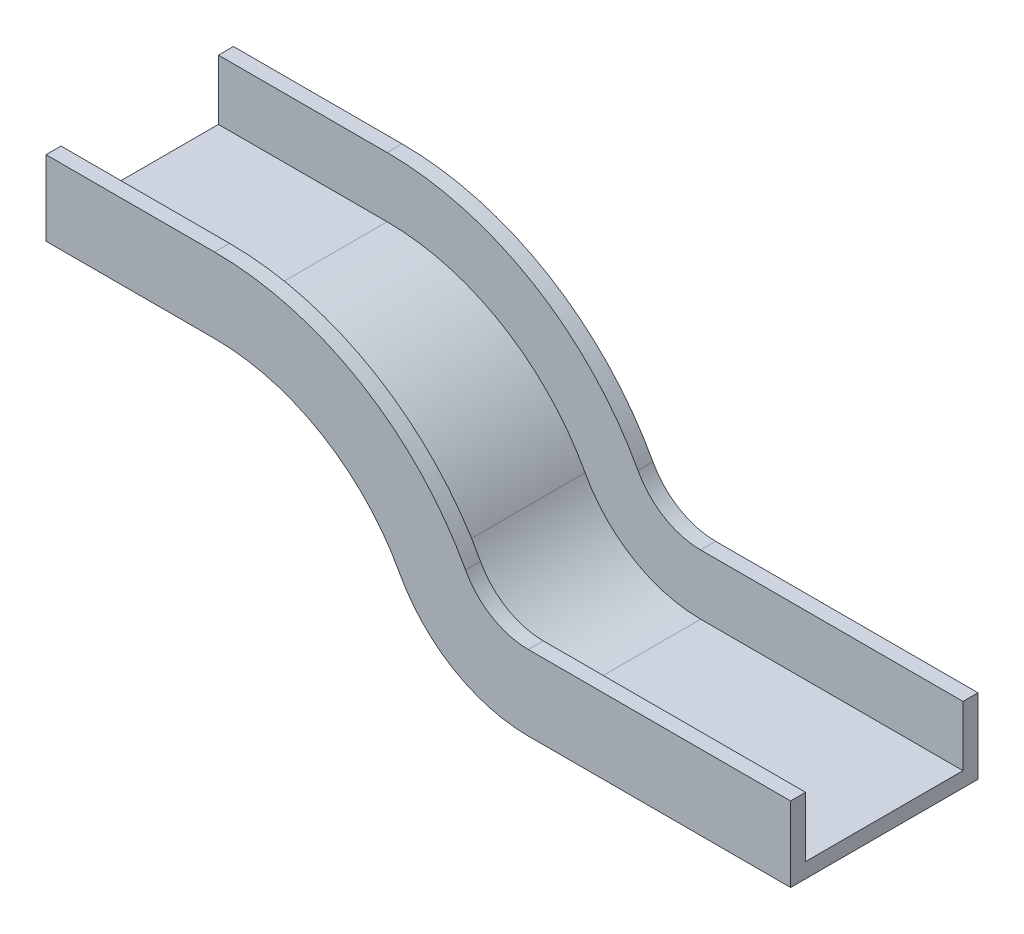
ISO-10303-21;
HEADER;
FILE_DESCRIPTION(('STEP AP214'),'2;1');
FILE_NAME('part.step','',(''),(''),'','','');
FILE_SCHEMA(('AUTOMOTIVE_DESIGN { 1 0 10303 214 1 1 1 1 }'));
ENDSEC;
DATA;
#1=APPLICATION_CONTEXT('core data for automotive mechanical design processes');
#2=APPLICATION_PROTOCOL_DEFINITION('international standard','automotive_design',2000,#1);
#3=PRODUCT_CONTEXT('',#1,'mechanical');
#4=PRODUCT('Part','Part','',(#3));
#5=PRODUCT_RELATED_PRODUCT_CATEGORY('part','',(#4));
#6=PRODUCT_DEFINITION_FORMATION('','',#4);
#7=PRODUCT_DEFINITION_CONTEXT('part definition',#1,'design');
#8=PRODUCT_DEFINITION('design','',#6,#7);
#9=PRODUCT_DEFINITION_SHAPE('','',#8);
#10=(LENGTH_UNIT() NAMED_UNIT(*) SI_UNIT(.MILLI.,.METRE.));
#11=(NAMED_UNIT(*) PLANE_ANGLE_UNIT() SI_UNIT($,.RADIAN.));
#12=(NAMED_UNIT(*) SI_UNIT($,.STERADIAN.) SOLID_ANGLE_UNIT());
#13=UNCERTAINTY_MEASURE_WITH_UNIT(LENGTH_MEASURE(1.E-05),#10,'distance_accuracy_value','');
#14=(GEOMETRIC_REPRESENTATION_CONTEXT(3) GLOBAL_UNCERTAINTY_ASSIGNED_CONTEXT((#13)) GLOBAL_UNIT_ASSIGNED_CONTEXT((#10,
#11,#12)) REPRESENTATION_CONTEXT('',''));
#15=CARTESIAN_POINT('',(0.,0.,0.));
#16=DIRECTION('',(0.,0.,1.));
#17=DIRECTION('',(1.,0.,0.));
#18=AXIS2_PLACEMENT_3D('',#15,#16,#17);
#19=CARTESIAN_POINT('',(128.666002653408,-50.,-21.));
#20=DIRECTION('',(0.,1.,0.));
#21=DIRECTION('',(-1.,0.,0.));
#22=AXIS2_PLACEMENT_3D('',#19,#20,#21);
#23=PLANE('',#22);
#24=DIRECTION('',(0.,0.,1.));
#25=VECTOR('',#24,1.);
#26=CARTESIAN_POINT('',(128.666002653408,-50.,-21.));
#27=LINE('',#26,#25);
#28=CARTESIAN_POINT('',(128.666002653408,-50.,-21.));
#29=VERTEX_POINT('',#28);
#30=CARTESIAN_POINT('',(128.666002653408,-50.,21.));
#31=VERTEX_POINT('',#30);
#32=EDGE_CURVE('E279',#29,#31,#27,.T.);
#33=ORIENTED_EDGE('',*,*,#32,.T.);
#34=DIRECTION('',(1.,0.,0.));
#35=VECTOR('',#34,1.);
#36=CARTESIAN_POINT('',(128.666002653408,-50.,21.));
#37=LINE('',#36,#35);
#38=CARTESIAN_POINT('',(198.666002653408,-50.,21.));
#39=VERTEX_POINT('',#38);
#40=EDGE_CURVE('E340',#31,#39,#37,.T.);
#41=ORIENTED_EDGE('',*,*,#40,.T.);
#42=DIRECTION('',(0.,0.,1.));
#43=VECTOR('',#42,1.);
#44=CARTESIAN_POINT('',(198.666002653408,-50.,-21.));
#45=LINE('',#44,#43);
#46=CARTESIAN_POINT('',(198.666002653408,-50.,-21.));
#47=VERTEX_POINT('',#46);
#48=EDGE_CURVE('E55',#47,#39,#45,.T.);
#49=ORIENTED_EDGE('',*,*,#48,.F.);
#50=DIRECTION('',(1.,0.,0.));
#51=VECTOR('',#50,1.);
#52=CARTESIAN_POINT('',(128.666002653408,-50.,-21.));
#53=LINE('',#52,#51);
#54=EDGE_CURVE('E40',#29,#47,#53,.T.);
#55=ORIENTED_EDGE('',*,*,#54,.F.);
#56=EDGE_LOOP('',(#33,#41,#49,#55));
#57=FACE_BOUND('',#56,.T.);
#58=ADVANCED_FACE('F33',(#57),#23,.T.);
#59=CARTESIAN_POINT('',(128.666002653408,-34.,21.));
#60=DIRECTION('',(0.,1.,0.));
#61=DIRECTION('',(-1.,0.,0.));
#62=AXIS2_PLACEMENT_3D('',#59,#60,#61);
#63=PLANE('',#62);
#64=DIRECTION('',(0.,0.,1.));
#65=VECTOR('',#64,1.);
#66=CARTESIAN_POINT('',(128.666002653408,-34.,21.));
#67=LINE('',#66,#65);
#68=CARTESIAN_POINT('',(128.666002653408,-34.,21.));
#69=VERTEX_POINT('',#68);
#70=CARTESIAN_POINT('',(128.666002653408,-34.,25.));
#71=VERTEX_POINT('',#70);
#72=EDGE_CURVE('E276',#69,#71,#67,.T.);
#73=ORIENTED_EDGE('',*,*,#72,.T.);
#74=DIRECTION('',(1.,0.,0.));
#75=VECTOR('',#74,1.);
#76=CARTESIAN_POINT('',(128.666002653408,-34.,25.));
#77=LINE('',#76,#75);
#78=CARTESIAN_POINT('',(198.666002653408,-34.,25.));
#79=VERTEX_POINT('',#78);
#80=EDGE_CURVE('E334',#71,#79,#77,.T.);
#81=ORIENTED_EDGE('',*,*,#80,.T.);
#82=DIRECTION('',(0.,0.,1.));
#83=VECTOR('',#82,1.);
#84=CARTESIAN_POINT('',(198.666002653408,-34.,21.));
#85=LINE('',#84,#83);
#86=CARTESIAN_POINT('',(198.666002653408,-34.,21.));
#87=VERTEX_POINT('',#86);
#88=EDGE_CURVE('E317',#87,#79,#85,.T.);
#89=ORIENTED_EDGE('',*,*,#88,.F.);
#90=DIRECTION('',(1.,0.,0.));
#91=VECTOR('',#90,1.);
#92=CARTESIAN_POINT('',(128.666002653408,-34.,21.));
#93=LINE('',#92,#91);
#94=EDGE_CURVE('E337',#69,#87,#93,.T.);
#95=ORIENTED_EDGE('',*,*,#94,.F.);
#96=EDGE_LOOP('',(#73,#81,#89,#95));
#97=FACE_BOUND('',#96,.T.);
#98=ADVANCED_FACE('F393',(#97),#63,.T.);
#99=CARTESIAN_POINT('',(128.666002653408,-54.,25.));
#100=DIRECTION('',(0.,-1.,0.));
#101=DIRECTION('',(1.,0.,0.));
#102=AXIS2_PLACEMENT_3D('',#99,#100,#101);
#103=PLANE('',#102);
#104=DIRECTION('',(0.,0.,-1.));
#105=VECTOR('',#104,1.);
#106=CARTESIAN_POINT('',(128.666002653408,-54.,25.));
#107=LINE('',#106,#105);
#108=CARTESIAN_POINT('',(128.666002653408,-54.,25.));
#109=VERTEX_POINT('',#108);
#110=CARTESIAN_POINT('',(128.666002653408,-54.,-25.));
#111=VERTEX_POINT('',#110);
#112=EDGE_CURVE('E273',#109,#111,#107,.T.);
#113=ORIENTED_EDGE('',*,*,#112,.T.);
#114=DIRECTION('',(1.,0.,0.));
#115=VECTOR('',#114,1.);
#116=CARTESIAN_POINT('',(128.666002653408,-54.,-25.));
#117=LINE('',#116,#115);
#118=CARTESIAN_POINT('',(198.666002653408,-54.,-25.));
#119=VERTEX_POINT('',#118);
#120=EDGE_CURVE('E328',#111,#119,#117,.T.);
#121=ORIENTED_EDGE('',*,*,#120,.T.);
#122=DIRECTION('',(0.,0.,-1.));
#123=VECTOR('',#122,1.);
#124=CARTESIAN_POINT('',(198.666002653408,-54.,25.));
#125=LINE('',#124,#123);
#126=CARTESIAN_POINT('',(198.666002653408,-54.,25.));
#127=VERTEX_POINT('',#126);
#128=EDGE_CURVE('E311',#127,#119,#125,.T.);
#129=ORIENTED_EDGE('',*,*,#128,.F.);
#130=DIRECTION('',(1.,0.,0.));
#131=VECTOR('',#130,1.);
#132=CARTESIAN_POINT('',(128.666002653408,-54.,25.));
#133=LINE('',#132,#131);
#134=EDGE_CURVE('E331',#109,#127,#133,.T.);
#135=ORIENTED_EDGE('',*,*,#134,.F.);
#136=EDGE_LOOP('',(#113,#121,#129,#135));
#137=FACE_BOUND('',#136,.T.);
#138=ADVANCED_FACE('F397',(#137),#103,.T.);
#139=CARTESIAN_POINT('',(128.666002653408,-34.,-21.));
#140=DIRECTION('',(0.,1.,0.));
#141=DIRECTION('',(-1.,0.,0.));
#142=AXIS2_PLACEMENT_3D('',#139,#140,#141);
#143=PLANE('',#142);
#144=DIRECTION('',(0.,0.,1.));
#145=VECTOR('',#144,1.);
#146=CARTESIAN_POINT('',(128.666002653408,-34.,-21.));
#147=LINE('',#146,#145);
#148=CARTESIAN_POINT('',(128.666002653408,-34.,-25.));
#149=VERTEX_POINT('',#148);
#150=CARTESIAN_POINT('',(128.666002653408,-34.,-21.));
#151=VERTEX_POINT('',#150);
#152=EDGE_CURVE('E270',#149,#151,#147,.T.);
#153=ORIENTED_EDGE('',*,*,#152,.T.);
#154=DIRECTION('',(1.,0.,0.));
#155=VECTOR('',#154,1.);
#156=CARTESIAN_POINT('',(128.666002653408,-34.,-21.));
#157=LINE('',#156,#155);
#158=CARTESIAN_POINT('',(198.666002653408,-34.,-21.));
#159=VERTEX_POINT('',#158);
#160=EDGE_CURVE('E11',#151,#159,#157,.T.);
#161=ORIENTED_EDGE('',*,*,#160,.T.);
#162=DIRECTION('',(0.,0.,1.));
#163=VECTOR('',#162,1.);
#164=CARTESIAN_POINT('',(198.666002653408,-34.,-21.));
#165=LINE('',#164,#163);
#166=CARTESIAN_POINT('',(198.666002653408,-34.,-25.));
#167=VERTEX_POINT('',#166);
#168=EDGE_CURVE('E306',#167,#159,#165,.T.);
#169=ORIENTED_EDGE('',*,*,#168,.F.);
#170=DIRECTION('',(1.,0.,0.));
#171=VECTOR('',#170,1.);
#172=CARTESIAN_POINT('',(128.666002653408,-34.,-25.));
#173=LINE('',#172,#171);
#174=EDGE_CURVE('E325',#149,#167,#173,.T.);
#175=ORIENTED_EDGE('',*,*,#174,.F.);
#176=EDGE_LOOP('',(#153,#161,#169,#175));
#177=FACE_BOUND('',#176,.T.);
#178=ADVANCED_FACE('F350',(#177),#143,.T.);
#179=CARTESIAN_POINT('',(128.666002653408,-15.,0.));
#180=DIRECTION('',(0.,0.,1.));
#181=DIRECTION('',(1.,0.,0.));
#182=AXIS2_PLACEMENT_3D('',#179,#180,#181);
#183=CYLINDRICAL_SURFACE('',#182,35.);
#184=DIRECTION('',(0.,0.,1.));
#185=VECTOR('',#184,1.);
#186=CARTESIAN_POINT('',(97.8416858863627,-31.5789473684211,-21.));
#187=LINE('',#186,#185);
#188=CARTESIAN_POINT('',(97.8416858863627,-31.5789473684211,-21.));
#189=VERTEX_POINT('',#188);
#190=CARTESIAN_POINT('',(97.8416858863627,-31.5789473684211,21.));
#191=VERTEX_POINT('',#190);
#192=EDGE_CURVE('E245',#189,#191,#187,.T.);
#193=ORIENTED_EDGE('',*,*,#192,.T.);
#194=CARTESIAN_POINT('',(128.666002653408,-15.,21.));
#195=DIRECTION('',(0.,0.,1.));
#196=DIRECTION('',(1.,0.,0.));
#197=AXIS2_PLACEMENT_3D('',#194,#195,#196);
#198=CIRCLE('',#197,35.);
#199=EDGE_CURVE('E297',#191,#31,#198,.T.);
#200=ORIENTED_EDGE('',*,*,#199,.T.);
#201=ORIENTED_EDGE('',*,*,#32,.F.);
#202=CARTESIAN_POINT('',(128.666002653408,-15.,-21.));
#203=DIRECTION('',(0.,0.,1.));
#204=DIRECTION('',(1.,0.,0.));
#205=AXIS2_PLACEMENT_3D('',#202,#203,#204);
#206=CIRCLE('',#205,35.);
#207=EDGE_CURVE('E300',#189,#29,#206,.T.);
#208=ORIENTED_EDGE('',*,*,#207,.F.);
#209=EDGE_LOOP('',(#193,#200,#201,#208));
#210=FACE_BOUND('',#209,.T.);
#211=ADVANCED_FACE('F343',(#210),#183,.F.);
#212=CARTESIAN_POINT('',(128.666002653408,-15.,0.));
#213=DIRECTION('',(0.,0.,1.));
#214=DIRECTION('',(1.,0.,0.));
#215=AXIS2_PLACEMENT_3D('',#212,#213,#214);
#216=CYLINDRICAL_SURFACE('',#215,19.);
#217=DIRECTION('',(0.,0.,1.));
#218=VECTOR('',#217,1.);
#219=CARTESIAN_POINT('',(111.932802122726,-24.,21.));
#220=LINE('',#219,#218);
#221=CARTESIAN_POINT('',(111.932802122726,-24.,21.));
#222=VERTEX_POINT('',#221);
#223=CARTESIAN_POINT('',(111.932802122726,-24.,25.));
#224=VERTEX_POINT('',#223);
#225=EDGE_CURVE('E242',#222,#224,#220,.T.);
#226=ORIENTED_EDGE('',*,*,#225,.T.);
#227=CARTESIAN_POINT('',(128.666002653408,-15.,25.));
#228=DIRECTION('',(0.,0.,1.));
#229=DIRECTION('',(1.,0.,0.));
#230=AXIS2_PLACEMENT_3D('',#227,#228,#229);
#231=CIRCLE('',#230,19.);
#232=EDGE_CURVE('E291',#224,#71,#231,.T.);
#233=ORIENTED_EDGE('',*,*,#232,.T.);
#234=ORIENTED_EDGE('',*,*,#72,.F.);
#235=CARTESIAN_POINT('',(128.666002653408,-15.,21.));
#236=DIRECTION('',(0.,0.,1.));
#237=DIRECTION('',(1.,0.,0.));
#238=AXIS2_PLACEMENT_3D('',#235,#236,#237);
#239=CIRCLE('',#238,19.);
#240=EDGE_CURVE('E294',#222,#69,#239,.T.);
#241=ORIENTED_EDGE('',*,*,#240,.F.);
#242=EDGE_LOOP('',(#226,#233,#234,#241));
#243=FACE_BOUND('',#242,.T.);
#244=ADVANCED_FACE('F409',(#243),#216,.F.);
#245=CARTESIAN_POINT('',(128.666002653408,-15.,0.));
#246=DIRECTION('',(0.,0.,1.));
#247=DIRECTION('',(1.,0.,0.));
#248=AXIS2_PLACEMENT_3D('',#245,#246,#247);
#249=CYLINDRICAL_SURFACE('',#248,39.);
#250=DIRECTION('',(0.,0.,-1.));
#251=VECTOR('',#250,1.);
#252=CARTESIAN_POINT('',(94.3189068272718,-33.4736842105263,25.));
#253=LINE('',#252,#251);
#254=CARTESIAN_POINT('',(94.3189068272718,-33.4736842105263,25.));
#255=VERTEX_POINT('',#254);
#256=CARTESIAN_POINT('',(94.3189068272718,-33.4736842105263,-25.));
#257=VERTEX_POINT('',#256);
#258=EDGE_CURVE('E239',#255,#257,#253,.T.);
#259=ORIENTED_EDGE('',*,*,#258,.T.);
#260=CARTESIAN_POINT('',(128.666002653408,-15.,-25.));
#261=DIRECTION('',(0.,0.,1.));
#262=DIRECTION('',(1.,0.,0.));
#263=AXIS2_PLACEMENT_3D('',#260,#261,#262);
#264=CIRCLE('',#263,39.);
#265=EDGE_CURVE('E285',#257,#111,#264,.T.);
#266=ORIENTED_EDGE('',*,*,#265,.T.);
#267=ORIENTED_EDGE('',*,*,#112,.F.);
#268=CARTESIAN_POINT('',(128.666002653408,-15.,25.));
#269=DIRECTION('',(0.,0.,1.));
#270=DIRECTION('',(1.,0.,0.));
#271=AXIS2_PLACEMENT_3D('',#268,#269,#270);
#272=CIRCLE('',#271,39.);
#273=EDGE_CURVE('E288',#255,#109,#272,.T.);
#274=ORIENTED_EDGE('',*,*,#273,.F.);
#275=EDGE_LOOP('',(#259,#266,#267,#274));
#276=FACE_BOUND('',#275,.T.);
#277=ADVANCED_FACE('F390',(#276),#249,.T.);
#278=CARTESIAN_POINT('',(128.666002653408,-15.,0.));
#279=DIRECTION('',(0.,0.,1.));
#280=DIRECTION('',(1.,0.,0.));
#281=AXIS2_PLACEMENT_3D('',#278,#279,#280);
#282=CYLINDRICAL_SURFACE('',#281,19.);
#283=DIRECTION('',(0.,0.,1.));
#284=VECTOR('',#283,1.);
#285=CARTESIAN_POINT('',(111.932802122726,-24.,-21.));
#286=LINE('',#285,#284);
#287=CARTESIAN_POINT('',(111.932802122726,-24.,-25.));
#288=VERTEX_POINT('',#287);
#289=CARTESIAN_POINT('',(111.932802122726,-24.,-21.));
#290=VERTEX_POINT('',#289);
#291=EDGE_CURVE('E189',#288,#290,#286,.T.);
#292=ORIENTED_EDGE('',*,*,#291,.T.);
#293=CARTESIAN_POINT('',(128.666002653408,-15.,-21.));
#294=DIRECTION('',(0.,0.,1.));
#295=DIRECTION('',(1.,0.,0.));
#296=AXIS2_PLACEMENT_3D('',#293,#294,#295);
#297=CIRCLE('',#296,19.);
#298=EDGE_CURVE('E303',#290,#151,#297,.T.);
#299=ORIENTED_EDGE('',*,*,#298,.T.);
#300=ORIENTED_EDGE('',*,*,#152,.F.);
#301=CARTESIAN_POINT('',(128.666002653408,-15.,-25.));
#302=DIRECTION('',(0.,0.,1.));
#303=DIRECTION('',(1.,0.,0.));
#304=AXIS2_PLACEMENT_3D('',#301,#302,#303);
#305=CIRCLE('',#304,19.);
#306=EDGE_CURVE('E282',#288,#149,#305,.T.);
#307=ORIENTED_EDGE('',*,*,#306,.F.);
#308=EDGE_LOOP('',(#292,#299,#300,#307));
#309=FACE_BOUND('',#308,.T.);
#310=ADVANCED_FACE('F354',(#309),#282,.F.);
#311=CARTESIAN_POINT('',(45.,-60.,0.));
#312=DIRECTION('',(0.,0.,-1.));
#313=DIRECTION('',(-1.,0.,0.));
#314=AXIS2_PLACEMENT_3D('',#311,#312,#313);
#315=CYLINDRICAL_SURFACE('',#314,60.);
#316=DIRECTION('',(0.,0.,1.));
#317=VECTOR('',#316,1.);
#318=CARTESIAN_POINT('',(45.,0.,-21.));
#319=LINE('',#318,#317);
#320=CARTESIAN_POINT('',(45.,0.,-21.));
#321=VERTEX_POINT('',#320);
#322=CARTESIAN_POINT('',(45.,0.,21.));
#323=VERTEX_POINT('',#322);
#324=EDGE_CURVE('E211',#321,#323,#319,.T.);
#325=ORIENTED_EDGE('',*,*,#324,.T.);
#326=CARTESIAN_POINT('',(45.,-60.,21.));
#327=DIRECTION('',(0.,0.,-1.));
#328=DIRECTION('',(-1.,0.,0.));
#329=AXIS2_PLACEMENT_3D('',#326,#327,#328);
#330=CIRCLE('',#329,60.);
#331=EDGE_CURVE('E263',#323,#191,#330,.T.);
#332=ORIENTED_EDGE('',*,*,#331,.T.);
#333=ORIENTED_EDGE('',*,*,#192,.F.);
#334=CARTESIAN_POINT('',(45.,-60.,-21.));
#335=DIRECTION('',(0.,0.,-1.));
#336=DIRECTION('',(-1.,0.,0.));
#337=AXIS2_PLACEMENT_3D('',#334,#335,#336);
#338=CIRCLE('',#337,60.);
#339=EDGE_CURVE('E266',#321,#189,#338,.T.);
#340=ORIENTED_EDGE('',*,*,#339,.F.);
#341=EDGE_LOOP('',(#325,#332,#333,#340));
#342=FACE_BOUND('',#341,.T.);
#343=ADVANCED_FACE('F379',(#342),#315,.T.);
#344=CARTESIAN_POINT('',(45.,-60.,0.));
#345=DIRECTION('',(0.,0.,-1.));
#346=DIRECTION('',(-1.,0.,0.));
#347=AXIS2_PLACEMENT_3D('',#344,#345,#346);
#348=CYLINDRICAL_SURFACE('',#347,76.);
#349=DIRECTION('',(0.,0.,1.));
#350=VECTOR('',#349,1.);
#351=CARTESIAN_POINT('',(45.,16.,21.));
#352=LINE('',#351,#350);
#353=CARTESIAN_POINT('',(45.,16.,21.));
#354=VERTEX_POINT('',#353);
#355=CARTESIAN_POINT('',(45.,16.,25.));
#356=VERTEX_POINT('',#355);
#357=EDGE_CURVE('E214',#354,#356,#352,.T.);
#358=ORIENTED_EDGE('',*,*,#357,.T.);
#359=CARTESIAN_POINT('',(45.,-60.,25.));
#360=DIRECTION('',(0.,0.,-1.));
#361=DIRECTION('',(-1.,0.,0.));
#362=AXIS2_PLACEMENT_3D('',#359,#360,#361);
#363=CIRCLE('',#362,76.);
#364=EDGE_CURVE('E257',#356,#224,#363,.T.);
#365=ORIENTED_EDGE('',*,*,#364,.T.);
#366=ORIENTED_EDGE('',*,*,#225,.F.);
#367=CARTESIAN_POINT('',(45.,-60.,21.));
#368=DIRECTION('',(0.,0.,-1.));
#369=DIRECTION('',(-1.,0.,0.));
#370=AXIS2_PLACEMENT_3D('',#367,#368,#369);
#371=CIRCLE('',#370,76.);
#372=EDGE_CURVE('E260',#354,#222,#371,.T.);
#373=ORIENTED_EDGE('',*,*,#372,.F.);
#374=EDGE_LOOP('',(#358,#365,#366,#373));
#375=FACE_BOUND('',#374,.T.);
#376=ADVANCED_FACE('F381',(#375),#348,.T.);
#377=CARTESIAN_POINT('',(45.,-60.,0.));
#378=DIRECTION('',(0.,0.,-1.));
#379=DIRECTION('',(-1.,0.,0.));
#380=AXIS2_PLACEMENT_3D('',#377,#378,#379);
#381=CYLINDRICAL_SURFACE('',#380,56.);
#382=DIRECTION('',(0.,0.,-1.));
#383=VECTOR('',#382,1.);
#384=CARTESIAN_POINT('',(45.,-4.00000000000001,25.));
#385=LINE('',#384,#383);
#386=CARTESIAN_POINT('',(45.,-4.00000000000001,25.));
#387=VERTEX_POINT('',#386);
#388=CARTESIAN_POINT('',(45.,-4.00000000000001,-25.));
#389=VERTEX_POINT('',#388);
#390=EDGE_CURVE('E217',#387,#389,#385,.T.);
#391=ORIENTED_EDGE('',*,*,#390,.T.);
#392=CARTESIAN_POINT('',(45.,-60.,-25.));
#393=DIRECTION('',(0.,0.,-1.));
#394=DIRECTION('',(-1.,0.,0.));
#395=AXIS2_PLACEMENT_3D('',#392,#393,#394);
#396=CIRCLE('',#395,56.);
#397=EDGE_CURVE('E251',#389,#257,#396,.T.);
#398=ORIENTED_EDGE('',*,*,#397,.T.);
#399=ORIENTED_EDGE('',*,*,#258,.F.);
#400=CARTESIAN_POINT('',(45.,-60.,25.));
#401=DIRECTION('',(0.,0.,-1.));
#402=DIRECTION('',(-1.,0.,0.));
#403=AXIS2_PLACEMENT_3D('',#400,#401,#402);
#404=CIRCLE('',#403,56.);
#405=EDGE_CURVE('E254',#387,#255,#404,.T.);
#406=ORIENTED_EDGE('',*,*,#405,.F.);
#407=EDGE_LOOP('',(#391,#398,#399,#406));
#408=FACE_BOUND('',#407,.T.);
#409=ADVANCED_FACE('F387',(#408),#381,.F.);
#410=CARTESIAN_POINT('',(45.,-60.,0.));
#411=DIRECTION('',(0.,0.,-1.));
#412=DIRECTION('',(-1.,0.,0.));
#413=AXIS2_PLACEMENT_3D('',#410,#411,#412);
#414=CYLINDRICAL_SURFACE('',#413,76.);
#415=DIRECTION('',(0.,0.,1.));
#416=VECTOR('',#415,1.);
#417=CARTESIAN_POINT('',(45.,16.,-21.));
#418=LINE('',#417,#416);
#419=CARTESIAN_POINT('',(45.,16.,-25.));
#420=VERTEX_POINT('',#419);
#421=CARTESIAN_POINT('',(45.,16.,-21.));
#422=VERTEX_POINT('',#421);
#423=EDGE_CURVE('E209',#420,#422,#418,.T.);
#424=ORIENTED_EDGE('',*,*,#423,.T.);
#425=CARTESIAN_POINT('',(45.,-60.,-21.));
#426=DIRECTION('',(0.,0.,-1.));
#427=DIRECTION('',(-1.,0.,0.));
#428=AXIS2_PLACEMENT_3D('',#425,#426,#427);
#429=CIRCLE('',#428,76.);
#430=EDGE_CURVE('E185',#422,#290,#429,.T.);
#431=ORIENTED_EDGE('',*,*,#430,.T.);
#432=ORIENTED_EDGE('',*,*,#291,.F.);
#433=CARTESIAN_POINT('',(45.,-60.,-25.));
#434=DIRECTION('',(0.,0.,-1.));
#435=DIRECTION('',(-1.,0.,0.));
#436=AXIS2_PLACEMENT_3D('',#433,#434,#435);
#437=CIRCLE('',#436,76.);
#438=EDGE_CURVE('E248',#420,#288,#437,.T.);
#439=ORIENTED_EDGE('',*,*,#438,.F.);
#440=EDGE_LOOP('',(#424,#431,#432,#439));
#441=FACE_BOUND('',#440,.T.);
#442=ADVANCED_FACE('F356',(#441),#414,.T.);
#443=CARTESIAN_POINT('',(45.,16.,-21.));
#444=DIRECTION('',(0.,-1.,0.));
#445=DIRECTION('',(0.,0.,-1.));
#446=AXIS2_PLACEMENT_3D('',#443,#444,#445);
#447=PLANE('',#446);
#448=DIRECTION('',(0.,0.,1.));
#449=VECTOR('',#448,1.);
#450=CARTESIAN_POINT('',(0.,16.,-21.));
#451=LINE('',#450,#449);
#452=CARTESIAN_POINT('',(0.,16.,-25.));
#453=VERTEX_POINT('',#452);
#454=CARTESIAN_POINT('',(0.,16.,-21.));
#455=VERTEX_POINT('',#454);
#456=EDGE_CURVE('E175',#453,#455,#451,.T.);
#457=ORIENTED_EDGE('',*,*,#456,.T.);
#458=DIRECTION('',(-1.,0.,0.));
#459=VECTOR('',#458,1.);
#460=CARTESIAN_POINT('',(45.,16.,-21.));
#461=LINE('',#460,#459);
#462=EDGE_CURVE('E182',#422,#455,#461,.T.);
#463=ORIENTED_EDGE('',*,*,#462,.F.);
#464=ORIENTED_EDGE('',*,*,#423,.F.);
#465=DIRECTION('',(-1.,0.,0.));
#466=VECTOR('',#465,1.);
#467=CARTESIAN_POINT('',(45.,16.,-25.));
#468=LINE('',#467,#466);
#469=EDGE_CURVE('E195',#420,#453,#468,.T.);
#470=ORIENTED_EDGE('',*,*,#469,.T.);
#471=EDGE_LOOP('',(#457,#463,#464,#470));
#472=FACE_BOUND('',#471,.T.);
#473=ADVANCED_FACE('F193',(#472),#447,.F.);
#474=CARTESIAN_POINT('',(45.,0.,-21.));
#475=DIRECTION('',(0.,0.,-1.));
#476=DIRECTION('',(-1.,0.,0.));
#477=AXIS2_PLACEMENT_3D('',#474,#475,#476);
#478=PLANE('',#477);
#479=DIRECTION('',(0.,-1.,0.));
#480=VECTOR('',#479,1.);
#481=CARTESIAN_POINT('',(0.,0.,-21.));
#482=LINE('',#481,#480);
#483=CARTESIAN_POINT('',(0.,0.,-21.));
#484=VERTEX_POINT('',#483);
#485=EDGE_CURVE('E170',#455,#484,#482,.T.);
#486=ORIENTED_EDGE('',*,*,#485,.T.);
#487=DIRECTION('',(-1.,0.,0.));
#488=VECTOR('',#487,1.);
#489=CARTESIAN_POINT('',(45.,0.,-21.));
#490=LINE('',#489,#488);
#491=EDGE_CURVE('E190',#321,#484,#490,.T.);
#492=ORIENTED_EDGE('',*,*,#491,.F.);
#493=ORIENTED_EDGE('',*,*,#339,.T.);
#494=ORIENTED_EDGE('',*,*,#207,.T.);
#495=ORIENTED_EDGE('',*,*,#54,.T.);
#496=DIRECTION('',(0.,-1.,0.));
#497=VECTOR('',#496,1.);
#498=CARTESIAN_POINT('',(198.666002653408,-50.,-21.));
#499=LINE('',#498,#497);
#500=EDGE_CURVE('E47',#159,#47,#499,.T.);
#501=ORIENTED_EDGE('',*,*,#500,.F.);
#502=ORIENTED_EDGE('',*,*,#160,.F.);
#503=ORIENTED_EDGE('',*,*,#298,.F.);
#504=ORIENTED_EDGE('',*,*,#430,.F.);
#505=ORIENTED_EDGE('',*,*,#462,.T.);
#506=EDGE_LOOP('',(#486,#492,#493,#494,#495,#501,#502,#503,#504,#505));
#507=FACE_BOUND('',#506,.T.);
#508=ADVANCED_FACE('F183',(#507),#478,.F.);
#509=CARTESIAN_POINT('',(45.,0.,-21.));
#510=DIRECTION('',(0.,-1.,0.));
#511=DIRECTION('',(0.,0.,-1.));
#512=AXIS2_PLACEMENT_3D('',#509,#510,#511);
#513=PLANE('',#512);
#514=DIRECTION('',(0.,0.,1.));
#515=VECTOR('',#514,1.);
#516=CARTESIAN_POINT('',(0.,0.,-21.));
#517=LINE('',#516,#515);
#518=CARTESIAN_POINT('',(0.,0.,21.));
#519=VERTEX_POINT('',#518);
#520=EDGE_CURVE('E177',#484,#519,#517,.T.);
#521=ORIENTED_EDGE('',*,*,#520,.T.);
#522=DIRECTION('',(-1.,0.,0.));
#523=VECTOR('',#522,1.);
#524=CARTESIAN_POINT('',(45.,0.,21.));
#525=LINE('',#524,#523);
#526=EDGE_CURVE('E233',#323,#519,#525,.T.);
#527=ORIENTED_EDGE('',*,*,#526,.F.);
#528=ORIENTED_EDGE('',*,*,#324,.F.);
#529=ORIENTED_EDGE('',*,*,#491,.T.);
#530=EDGE_LOOP('',(#521,#527,#528,#529));
#531=FACE_BOUND('',#530,.T.);
#532=ADVANCED_FACE('F377',(#531),#513,.F.);
#533=CARTESIAN_POINT('',(45.,0.,21.));
#534=DIRECTION('',(0.,0.,1.));
#535=DIRECTION('',(1.,0.,0.));
#536=AXIS2_PLACEMENT_3D('',#533,#534,#535);
#537=PLANE('',#536);
#538=DIRECTION('',(0.,1.,0.));
#539=VECTOR('',#538,1.);
#540=CARTESIAN_POINT('',(0.,0.,21.));
#541=LINE('',#540,#539);
#542=CARTESIAN_POINT('',(0.,16.,21.));
#543=VERTEX_POINT('',#542);
#544=EDGE_CURVE('E199',#519,#543,#541,.T.);
#545=ORIENTED_EDGE('',*,*,#544,.T.);
#546=DIRECTION('',(-1.,0.,0.));
#547=VECTOR('',#546,1.);
#548=CARTESIAN_POINT('',(45.,16.,21.));
#549=LINE('',#548,#547);
#550=EDGE_CURVE('E230',#354,#543,#549,.T.);
#551=ORIENTED_EDGE('',*,*,#550,.F.);
#552=ORIENTED_EDGE('',*,*,#372,.T.);
#553=ORIENTED_EDGE('',*,*,#240,.T.);
#554=ORIENTED_EDGE('',*,*,#94,.T.);
#555=DIRECTION('',(0.,1.,0.));
#556=VECTOR('',#555,1.);
#557=CARTESIAN_POINT('',(198.666002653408,-50.,21.));
#558=LINE('',#557,#556);
#559=EDGE_CURVE('E320',#39,#87,#558,.T.);
#560=ORIENTED_EDGE('',*,*,#559,.F.);
#561=ORIENTED_EDGE('',*,*,#40,.F.);
#562=ORIENTED_EDGE('',*,*,#199,.F.);
#563=ORIENTED_EDGE('',*,*,#331,.F.);
#564=ORIENTED_EDGE('',*,*,#526,.T.);
#565=EDGE_LOOP('',(#545,#551,#552,#553,#554,#560,#561,#562,#563,#564));
#566=FACE_BOUND('',#565,.T.);
#567=ADVANCED_FACE('F346',(#566),#537,.F.);
#568=CARTESIAN_POINT('',(45.,16.,21.));
#569=DIRECTION('',(0.,-1.,0.));
#570=DIRECTION('',(0.,0.,-1.));
#571=AXIS2_PLACEMENT_3D('',#568,#569,#570);
#572=PLANE('',#571);
#573=DIRECTION('',(0.,0.,1.));
#574=VECTOR('',#573,1.);
#575=CARTESIAN_POINT('',(0.,16.,21.));
#576=LINE('',#575,#574);
#577=CARTESIAN_POINT('',(0.,16.,25.));
#578=VERTEX_POINT('',#577);
#579=EDGE_CURVE('E201',#543,#578,#576,.T.);
#580=ORIENTED_EDGE('',*,*,#579,.T.);
#581=DIRECTION('',(-1.,0.,0.));
#582=VECTOR('',#581,1.);
#583=CARTESIAN_POINT('',(45.,16.,25.));
#584=LINE('',#583,#582);
#585=EDGE_CURVE('E227',#356,#578,#584,.T.);
#586=ORIENTED_EDGE('',*,*,#585,.F.);
#587=ORIENTED_EDGE('',*,*,#357,.F.);
#588=ORIENTED_EDGE('',*,*,#550,.T.);
#589=EDGE_LOOP('',(#580,#586,#587,#588));
#590=FACE_BOUND('',#589,.T.);
#591=ADVANCED_FACE('F372',(#590),#572,.F.);
#592=CARTESIAN_POINT('',(45.,16.,25.));
#593=DIRECTION('',(0.,0.,-1.));
#594=DIRECTION('',(0.,1.,0.));
#595=AXIS2_PLACEMENT_3D('',#592,#593,#594);
#596=PLANE('',#595);
#597=DIRECTION('',(0.,-1.,0.));
#598=VECTOR('',#597,1.);
#599=CARTESIAN_POINT('',(0.,16.,25.));
#600=LINE('',#599,#598);
#601=CARTESIAN_POINT('',(0.,-4.00000000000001,25.));
#602=VERTEX_POINT('',#601);
#603=EDGE_CURVE('E203',#578,#602,#600,.T.);
#604=ORIENTED_EDGE('',*,*,#603,.T.);
#605=DIRECTION('',(-1.,0.,0.));
#606=VECTOR('',#605,1.);
#607=CARTESIAN_POINT('',(45.,-4.00000000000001,25.));
#608=LINE('',#607,#606);
#609=EDGE_CURVE('E224',#387,#602,#608,.T.);
#610=ORIENTED_EDGE('',*,*,#609,.F.);
#611=ORIENTED_EDGE('',*,*,#405,.T.);
#612=ORIENTED_EDGE('',*,*,#273,.T.);
#613=ORIENTED_EDGE('',*,*,#134,.T.);
#614=DIRECTION('',(0.,-1.,0.));
#615=VECTOR('',#614,1.);
#616=CARTESIAN_POINT('',(198.666002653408,-34.,25.));
#617=LINE('',#616,#615);
#618=EDGE_CURVE('E314',#79,#127,#617,.T.);
#619=ORIENTED_EDGE('',*,*,#618,.F.);
#620=ORIENTED_EDGE('',*,*,#80,.F.);
#621=ORIENTED_EDGE('',*,*,#232,.F.);
#622=ORIENTED_EDGE('',*,*,#364,.F.);
#623=ORIENTED_EDGE('',*,*,#585,.T.);
#624=EDGE_LOOP('',(#604,#610,#611,#612,#613,#619,#620,#621,#622,#623));
#625=FACE_BOUND('',#624,.T.);
#626=ADVANCED_FACE('F368',(#625),#596,.F.);
#627=CARTESIAN_POINT('',(45.,-4.00000000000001,25.));
#628=DIRECTION('',(0.,1.,0.));
#629=DIRECTION('',(0.,0.,1.));
#630=AXIS2_PLACEMENT_3D('',#627,#628,#629);
#631=PLANE('',#630);
#632=DIRECTION('',(0.,0.,-1.));
#633=VECTOR('',#632,1.);
#634=CARTESIAN_POINT('',(0.,-4.00000000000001,25.));
#635=LINE('',#634,#633);
#636=CARTESIAN_POINT('',(0.,-4.00000000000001,-25.));
#637=VERTEX_POINT('',#636);
#638=EDGE_CURVE('E205',#602,#637,#635,.T.);
#639=ORIENTED_EDGE('',*,*,#638,.T.);
#640=DIRECTION('',(-1.,0.,0.));
#641=VECTOR('',#640,1.);
#642=CARTESIAN_POINT('',(45.,-4.00000000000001,-25.));
#643=LINE('',#642,#641);
#644=EDGE_CURVE('E221',#389,#637,#643,.T.);
#645=ORIENTED_EDGE('',*,*,#644,.F.);
#646=ORIENTED_EDGE('',*,*,#390,.F.);
#647=ORIENTED_EDGE('',*,*,#609,.T.);
#648=EDGE_LOOP('',(#639,#645,#646,#647));
#649=FACE_BOUND('',#648,.T.);
#650=ADVANCED_FACE('F364',(#649),#631,.F.);
#651=CARTESIAN_POINT('',(45.,16.,-25.));
#652=DIRECTION('',(0.,0.,1.));
#653=DIRECTION('',(0.,-1.,0.));
#654=AXIS2_PLACEMENT_3D('',#651,#652,#653);
#655=PLANE('',#654);
#656=DIRECTION('',(0.,1.,0.));
#657=VECTOR('',#656,1.);
#658=CARTESIAN_POINT('',(0.,16.,-25.));
#659=LINE('',#658,#657);
#660=EDGE_CURVE('E207',#637,#453,#659,.T.);
#661=ORIENTED_EDGE('',*,*,#660,.T.);
#662=ORIENTED_EDGE('',*,*,#469,.F.);
#663=ORIENTED_EDGE('',*,*,#438,.T.);
#664=ORIENTED_EDGE('',*,*,#306,.T.);
#665=ORIENTED_EDGE('',*,*,#174,.T.);
#666=DIRECTION('',(0.,1.,0.));
#667=VECTOR('',#666,1.);
#668=CARTESIAN_POINT('',(198.666002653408,-34.,-25.));
#669=LINE('',#668,#667);
#670=EDGE_CURVE('E308',#119,#167,#669,.T.);
#671=ORIENTED_EDGE('',*,*,#670,.F.);
#672=ORIENTED_EDGE('',*,*,#120,.F.);
#673=ORIENTED_EDGE('',*,*,#265,.F.);
#674=ORIENTED_EDGE('',*,*,#397,.F.);
#675=ORIENTED_EDGE('',*,*,#644,.T.);
#676=EDGE_LOOP('',(#661,#662,#663,#664,#665,#671,#672,#673,#674,#675));
#677=FACE_BOUND('',#676,.T.);
#678=ADVANCED_FACE('F358',(#677),#655,.F.);
#679=CARTESIAN_POINT('',(198.666002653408,-34.,21.));
#680=DIRECTION('',(1.,0.,0.));
#681=DIRECTION('',(0.,0.,-1.));
#682=AXIS2_PLACEMENT_3D('',#679,#680,#681);
#683=PLANE('',#682);
#684=ORIENTED_EDGE('',*,*,#168,.T.);
#685=ORIENTED_EDGE('',*,*,#500,.T.);
#686=ORIENTED_EDGE('',*,*,#48,.T.);
#687=ORIENTED_EDGE('',*,*,#559,.T.);
#688=ORIENTED_EDGE('',*,*,#88,.T.);
#689=ORIENTED_EDGE('',*,*,#618,.T.);
#690=ORIENTED_EDGE('',*,*,#128,.T.);
#691=ORIENTED_EDGE('',*,*,#670,.T.);
#692=EDGE_LOOP('',(#684,#685,#686,#687,#688,#689,#690,#691));
#693=FACE_BOUND('',#692,.T.);
#694=ADVANCED_FACE('F348',(#693),#683,.T.);
#695=CARTESIAN_POINT('',(0.,16.,21.));
#696=DIRECTION('',(1.,0.,0.));
#697=DIRECTION('',(0.,0.,-1.));
#698=AXIS2_PLACEMENT_3D('',#695,#696,#697);
#699=PLANE('',#698);
#700=ORIENTED_EDGE('',*,*,#456,.F.);
#701=ORIENTED_EDGE('',*,*,#660,.F.);
#702=ORIENTED_EDGE('',*,*,#638,.F.);
#703=ORIENTED_EDGE('',*,*,#603,.F.);
#704=ORIENTED_EDGE('',*,*,#579,.F.);
#705=ORIENTED_EDGE('',*,*,#544,.F.);
#706=ORIENTED_EDGE('',*,*,#520,.F.);
#707=ORIENTED_EDGE('',*,*,#485,.F.);
#708=EDGE_LOOP('',(#700,#701,#702,#703,#704,#705,#706,#707));
#709=FACE_BOUND('',#708,.T.);
#710=ADVANCED_FACE('F172',(#709),#699,.F.);
#711=CLOSED_SHELL('',(#58,#98,#138,#178,#211,#244,#277,#310,#343,#376,#409,#442,#473,#508,#532,
#567,#591,#626,#650,#678,#694,#710));
#712=MANIFOLD_SOLID_BREP('B2',#711);
#713=ADVANCED_BREP_SHAPE_REPRESENTATION('',(#18,#712),#14);
#714=SHAPE_DEFINITION_REPRESENTATION(#9,#713);
ENDSEC;
END-ISO-10303-21;
